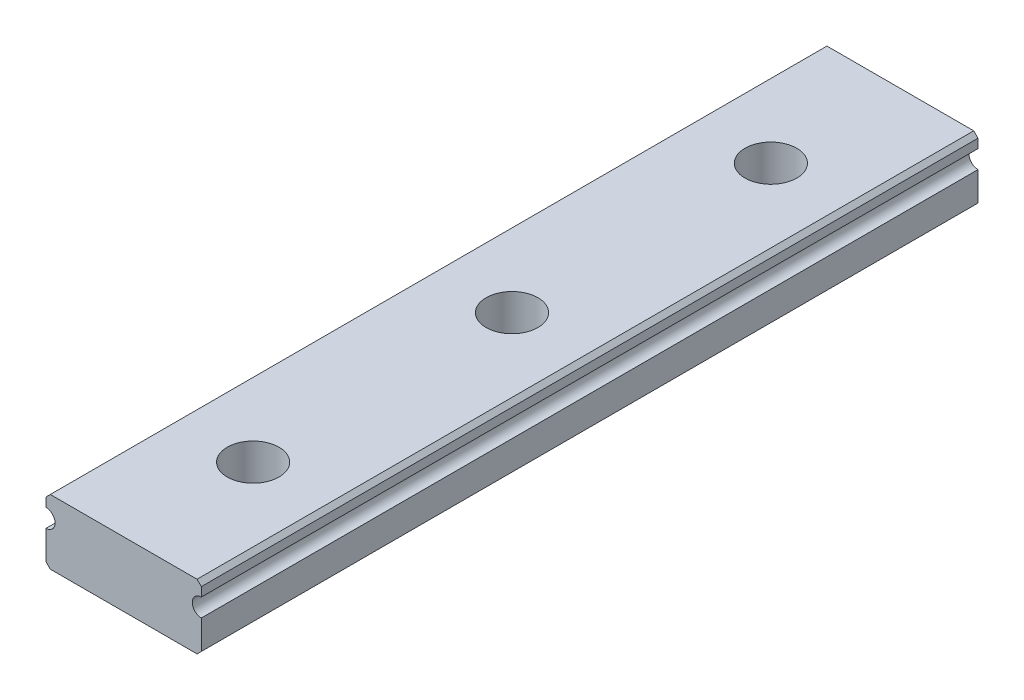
ISO-10303-21;
HEADER;
FILE_DESCRIPTION(('STEP AP214'),'2;1');
FILE_NAME('part.step','',(''),(''),'','','');
FILE_SCHEMA(('AUTOMOTIVE_DESIGN { 1 0 10303 214 1 1 1 1 }'));
ENDSEC;
DATA;
#1=APPLICATION_CONTEXT('core data for automotive mechanical design processes');
#2=APPLICATION_PROTOCOL_DEFINITION('international standard','automotive_design',2000,#1);
#3=PRODUCT_CONTEXT('',#1,'mechanical');
#4=PRODUCT('Part','Part','',(#3));
#5=PRODUCT_RELATED_PRODUCT_CATEGORY('part','',(#4));
#6=PRODUCT_DEFINITION_FORMATION('','',#4);
#7=PRODUCT_DEFINITION_CONTEXT('part definition',#1,'design');
#8=PRODUCT_DEFINITION('design','',#6,#7);
#9=PRODUCT_DEFINITION_SHAPE('','',#8);
#10=(LENGTH_UNIT() NAMED_UNIT(*) SI_UNIT(.MILLI.,.METRE.));
#11=(NAMED_UNIT(*) PLANE_ANGLE_UNIT() SI_UNIT($,.RADIAN.));
#12=(NAMED_UNIT(*) SI_UNIT($,.STERADIAN.) SOLID_ANGLE_UNIT());
#13=UNCERTAINTY_MEASURE_WITH_UNIT(LENGTH_MEASURE(1.E-05),#10,'distance_accuracy_value','');
#14=(GEOMETRIC_REPRESENTATION_CONTEXT(3) GLOBAL_UNCERTAINTY_ASSIGNED_CONTEXT((#13)) GLOBAL_UNIT_ASSIGNED_CONTEXT((#10,
#11,#12)) REPRESENTATION_CONTEXT('',''));
#15=CARTESIAN_POINT('',(0.,0.,0.));
#16=DIRECTION('',(0.,0.,1.));
#17=DIRECTION('',(1.,0.,0.));
#18=AXIS2_PLACEMENT_3D('',#15,#16,#17);
#19=CARTESIAN_POINT('',(-9.,7.00502525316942,200.));
#20=DIRECTION('',(1.,0.,0.));
#21=DIRECTION('',(0.,0.,-1.));
#22=AXIS2_PLACEMENT_3D('',#19,#20,#21);
#23=PLANE('',#22);
#24=DIRECTION('',(0.,0.,1.));
#25=VECTOR('',#24,1.);
#26=CARTESIAN_POINT('',(-9.,7.00502525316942,200.));
#27=LINE('',#26,#25);
#28=CARTESIAN_POINT('',(-9.,7.00502525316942,115.));
#29=VERTEX_POINT('',#28);
#30=CARTESIAN_POINT('',(-9.,7.00502525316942,25.));
#31=VERTEX_POINT('',#30);
#32=EDGE_CURVE('E197',#29,#31,#27,.F.);
#33=ORIENTED_EDGE('',*,*,#32,.T.);
#34=DIRECTION('',(0.,1.,0.));
#35=VECTOR('',#34,1.);
#36=CARTESIAN_POINT('',(-9.,7.00502525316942,25.));
#37=LINE('',#36,#35);
#38=CARTESIAN_POINT('',(-9.,5.956,25.));
#39=VERTEX_POINT('',#38);
#40=EDGE_CURVE('E202',#39,#31,#37,.T.);
#41=ORIENTED_EDGE('',*,*,#40,.F.);
#42=DIRECTION('',(0.,0.,-1.));
#43=VECTOR('',#42,1.);
#44=CARTESIAN_POINT('',(-9.,5.956,200.));
#45=LINE('',#44,#43);
#46=CARTESIAN_POINT('',(-9.,5.956,115.));
#47=VERTEX_POINT('',#46);
#48=EDGE_CURVE('E163',#39,#47,#45,.F.);
#49=ORIENTED_EDGE('',*,*,#48,.T.);
#50=DIRECTION('',(0.,1.,0.));
#51=VECTOR('',#50,1.);
#52=CARTESIAN_POINT('',(-9.,7.00502525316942,115.));
#53=LINE('',#52,#51);
#54=EDGE_CURVE('E126',#29,#47,#53,.F.);
#55=ORIENTED_EDGE('',*,*,#54,.F.);
#56=EDGE_LOOP('',(#33,#41,#49,#55));
#57=FACE_BOUND('',#56,.T.);
#58=ADVANCED_FACE('F17',(#57),#23,.F.);
#59=CARTESIAN_POINT('',(9.,5.956,200.));
#60=DIRECTION('',(-1.,0.,0.));
#61=DIRECTION('',(0.,0.,1.));
#62=AXIS2_PLACEMENT_3D('',#59,#60,#61);
#63=PLANE('',#62);
#64=DIRECTION('',(0.,0.,-1.));
#65=VECTOR('',#64,1.);
#66=CARTESIAN_POINT('',(9.,5.956,200.));
#67=LINE('',#66,#65);
#68=CARTESIAN_POINT('',(9.,5.956,115.));
#69=VERTEX_POINT('',#68);
#70=CARTESIAN_POINT('',(9.,5.956,25.));
#71=VERTEX_POINT('',#70);
#72=EDGE_CURVE('E109',#69,#71,#67,.T.);
#73=ORIENTED_EDGE('',*,*,#72,.T.);
#74=DIRECTION('',(0.,1.,0.));
#75=VECTOR('',#74,1.);
#76=CARTESIAN_POINT('',(9.,5.956,25.));
#77=LINE('',#76,#75);
#78=CARTESIAN_POINT('',(9.,7.00502525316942,25.));
#79=VERTEX_POINT('',#78);
#80=EDGE_CURVE('E117',#79,#71,#77,.F.);
#81=ORIENTED_EDGE('',*,*,#80,.F.);
#82=DIRECTION('',(0.,0.,1.));
#83=VECTOR('',#82,1.);
#84=CARTESIAN_POINT('',(9.,7.00502525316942,200.));
#85=LINE('',#84,#83);
#86=CARTESIAN_POINT('',(9.,7.00502525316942,115.));
#87=VERTEX_POINT('',#86);
#88=EDGE_CURVE('E211',#79,#87,#85,.T.);
#89=ORIENTED_EDGE('',*,*,#88,.T.);
#90=DIRECTION('',(0.,1.,0.));
#91=VECTOR('',#90,1.);
#92=CARTESIAN_POINT('',(9.,5.956,115.));
#93=LINE('',#92,#91);
#94=EDGE_CURVE('E125',#69,#87,#93,.T.);
#95=ORIENTED_EDGE('',*,*,#94,.F.);
#96=EDGE_LOOP('',(#73,#81,#89,#95));
#97=FACE_BOUND('',#96,.T.);
#98=ADVANCED_FACE('F128',(#97),#63,.F.);
#99=CARTESIAN_POINT('',(0.,0.,100.));
#100=DIRECTION('',(0.,1.,0.));
#101=DIRECTION('',(0.,0.,1.));
#102=AXIS2_PLACEMENT_3D('',#99,#100,#101);
#103=CYLINDRICAL_SURFACE('',#102,3.);
#104=CARTESIAN_POINT('',(0.,3.,100.));
#105=DIRECTION('',(0.,1.,0.));
#106=DIRECTION('',(0.,0.,1.));
#107=AXIS2_PLACEMENT_3D('',#104,#105,#106);
#108=CIRCLE('',#107,3.);
#109=CARTESIAN_POINT('',(0.,3.,103.));
#110=VERTEX_POINT('',#109);
#111=EDGE_CURVE('E20',#110,#110,#108,.T.);
#112=ORIENTED_EDGE('',*,*,#111,.F.);
#113=EDGE_LOOP('',(#112));
#114=FACE_BOUND('',#113,.T.);
#115=CARTESIAN_POINT('',(0.,7.5,100.));
#116=DIRECTION('',(0.,1.,0.));
#117=DIRECTION('',(0.,0.,1.));
#118=AXIS2_PLACEMENT_3D('',#115,#116,#117);
#119=CIRCLE('',#118,3.);
#120=CARTESIAN_POINT('',(0.,7.5,103.));
#121=VERTEX_POINT('',#120);
#122=EDGE_CURVE('E129',#121,#121,#119,.T.);
#123=ORIENTED_EDGE('',*,*,#122,.T.);
#124=EDGE_LOOP('',(#123));
#125=FACE_BOUND('',#124,.T.);
#126=ADVANCED_FACE('F270',(#114,#125),#103,.F.);
#127=CARTESIAN_POINT('',(0.,0.,70.));
#128=DIRECTION('',(0.,1.,0.));
#129=DIRECTION('',(0.,0.,1.));
#130=AXIS2_PLACEMENT_3D('',#127,#128,#129);
#131=CYLINDRICAL_SURFACE('',#130,3.);
#132=CARTESIAN_POINT('',(0.,3.,70.));
#133=DIRECTION('',(0.,1.,0.));
#134=DIRECTION('',(0.,0.,1.));
#135=AXIS2_PLACEMENT_3D('',#132,#133,#134);
#136=CIRCLE('',#135,3.);
#137=CARTESIAN_POINT('',(0.,3.,73.));
#138=VERTEX_POINT('',#137);
#139=EDGE_CURVE('E261',#138,#138,#136,.T.);
#140=ORIENTED_EDGE('',*,*,#139,.F.);
#141=EDGE_LOOP('',(#140));
#142=FACE_BOUND('',#141,.T.);
#143=CARTESIAN_POINT('',(0.,7.5,70.));
#144=DIRECTION('',(0.,1.,0.));
#145=DIRECTION('',(0.,0.,1.));
#146=AXIS2_PLACEMENT_3D('',#143,#144,#145);
#147=CIRCLE('',#146,3.);
#148=CARTESIAN_POINT('',(0.,7.5,73.));
#149=VERTEX_POINT('',#148);
#150=EDGE_CURVE('E132',#149,#149,#147,.T.);
#151=ORIENTED_EDGE('',*,*,#150,.T.);
#152=EDGE_LOOP('',(#151));
#153=FACE_BOUND('',#152,.T.);
#154=ADVANCED_FACE('F273',(#142,#153),#131,.F.);
#155=CARTESIAN_POINT('',(0.,0.,40.));
#156=DIRECTION('',(0.,1.,0.));
#157=DIRECTION('',(0.,0.,1.));
#158=AXIS2_PLACEMENT_3D('',#155,#156,#157);
#159=CYLINDRICAL_SURFACE('',#158,3.);
#160=CARTESIAN_POINT('',(0.,3.,40.));
#161=DIRECTION('',(0.,1.,0.));
#162=DIRECTION('',(0.,0.,1.));
#163=AXIS2_PLACEMENT_3D('',#160,#161,#162);
#164=CIRCLE('',#163,3.);
#165=CARTESIAN_POINT('',(0.,3.,43.));
#166=VERTEX_POINT('',#165);
#167=EDGE_CURVE('E177',#166,#166,#164,.T.);
#168=ORIENTED_EDGE('',*,*,#167,.F.);
#169=EDGE_LOOP('',(#168));
#170=FACE_BOUND('',#169,.T.);
#171=CARTESIAN_POINT('',(0.,7.5,40.));
#172=DIRECTION('',(0.,1.,0.));
#173=DIRECTION('',(0.,0.,1.));
#174=AXIS2_PLACEMENT_3D('',#171,#172,#173);
#175=CIRCLE('',#174,3.);
#176=CARTESIAN_POINT('',(0.,7.5,43.));
#177=VERTEX_POINT('',#176);
#178=EDGE_CURVE('E255',#177,#177,#175,.T.);
#179=ORIENTED_EDGE('',*,*,#178,.T.);
#180=EDGE_LOOP('',(#179));
#181=FACE_BOUND('',#180,.T.);
#182=ADVANCED_FACE('F350',(#170,#181),#159,.F.);
#183=CARTESIAN_POINT('',(-8.50502525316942,7.5,200.));
#184=DIRECTION('',(0.707106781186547,-0.707106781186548,0.));
#185=DIRECTION('',(0.707106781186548,0.707106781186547,0.));
#186=AXIS2_PLACEMENT_3D('',#183,#184,#185);
#187=PLANE('',#186);
#188=DIRECTION('',(0.,0.,-1.));
#189=VECTOR('',#188,1.);
#190=CARTESIAN_POINT('',(-8.50502525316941,7.5,200.));
#191=LINE('',#190,#189);
#192=CARTESIAN_POINT('',(-8.50502525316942,7.5,115.));
#193=VERTEX_POINT('',#192);
#194=CARTESIAN_POINT('',(-8.50502525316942,7.5,25.));
#195=VERTEX_POINT('',#194);
#196=EDGE_CURVE('E137',#193,#195,#191,.T.);
#197=ORIENTED_EDGE('',*,*,#196,.T.);
#198=DIRECTION('',(0.707106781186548,0.707106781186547,0.));
#199=VECTOR('',#198,1.);
#200=CARTESIAN_POINT('',(-8.50502525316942,7.5,25.));
#201=LINE('',#200,#199);
#202=EDGE_CURVE('E223',#31,#195,#201,.T.);
#203=ORIENTED_EDGE('',*,*,#202,.F.);
#204=ORIENTED_EDGE('',*,*,#32,.F.);
#205=DIRECTION('',(0.707106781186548,0.707106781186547,0.));
#206=VECTOR('',#205,1.);
#207=CARTESIAN_POINT('',(-8.50502525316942,7.5,115.));
#208=LINE('',#207,#206);
#209=EDGE_CURVE('E218',#193,#29,#208,.F.);
#210=ORIENTED_EDGE('',*,*,#209,.F.);
#211=EDGE_LOOP('',(#197,#203,#204,#210));
#212=FACE_BOUND('',#211,.T.);
#213=ADVANCED_FACE('F346',(#212),#187,.F.);
#214=CARTESIAN_POINT('',(9.,7.00502525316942,200.));
#215=DIRECTION('',(-0.707106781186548,-0.707106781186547,0.));
#216=DIRECTION('',(0.707106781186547,-0.707106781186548,0.));
#217=AXIS2_PLACEMENT_3D('',#214,#215,#216);
#218=PLANE('',#217);
#219=ORIENTED_EDGE('',*,*,#88,.F.);
#220=DIRECTION('',(0.707106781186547,-0.707106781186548,0.));
#221=VECTOR('',#220,1.);
#222=CARTESIAN_POINT('',(9.,7.00502525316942,25.));
#223=LINE('',#222,#221);
#224=CARTESIAN_POINT('',(8.50502525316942,7.5,25.));
#225=VERTEX_POINT('',#224);
#226=EDGE_CURVE('E121',#225,#79,#223,.T.);
#227=ORIENTED_EDGE('',*,*,#226,.F.);
#228=DIRECTION('',(0.,0.,-1.));
#229=VECTOR('',#228,1.);
#230=CARTESIAN_POINT('',(8.50502525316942,7.5,200.));
#231=LINE('',#230,#229);
#232=CARTESIAN_POINT('',(8.50502525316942,7.5,115.));
#233=VERTEX_POINT('',#232);
#234=EDGE_CURVE('E254',#225,#233,#231,.F.);
#235=ORIENTED_EDGE('',*,*,#234,.T.);
#236=DIRECTION('',(0.707106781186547,-0.707106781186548,0.));
#237=VECTOR('',#236,1.);
#238=CARTESIAN_POINT('',(9.,7.00502525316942,115.));
#239=LINE('',#238,#237);
#240=EDGE_CURVE('E209',#87,#233,#239,.F.);
#241=ORIENTED_EDGE('',*,*,#240,.F.);
#242=EDGE_LOOP('',(#219,#227,#235,#241));
#243=FACE_BOUND('',#242,.T.);
#244=ADVANCED_FACE('F339',(#243),#218,.F.);
#245=CARTESIAN_POINT('',(0.,3.,97.));
#246=DIRECTION('',(0.,1.,0.));
#247=DIRECTION('',(0.,0.,1.));
#248=AXIS2_PLACEMENT_3D('',#245,#246,#247);
#249=PLANE('',#248);
#250=CARTESIAN_POINT('',(0.,3.,100.));
#251=DIRECTION('',(0.,1.,0.));
#252=DIRECTION('',(0.,0.,1.));
#253=AXIS2_PLACEMENT_3D('',#250,#251,#252);
#254=CIRCLE('',#253,1.75);
#255=CARTESIAN_POINT('',(0.,3.,101.75));
#256=VERTEX_POINT('',#255);
#257=EDGE_CURVE('E251',#256,#256,#254,.F.);
#258=ORIENTED_EDGE('',*,*,#257,.T.);
#259=EDGE_LOOP('',(#258));
#260=FACE_BOUND('',#259,.T.);
#261=ORIENTED_EDGE('',*,*,#111,.T.);
#262=EDGE_LOOP('',(#261));
#263=FACE_BOUND('',#262,.T.);
#264=ADVANCED_FACE('F268',(#260,#263),#249,.T.);
#265=CARTESIAN_POINT('',(0.,3.,67.));
#266=DIRECTION('',(0.,1.,0.));
#267=DIRECTION('',(0.,0.,1.));
#268=AXIS2_PLACEMENT_3D('',#265,#266,#267);
#269=PLANE('',#268);
#270=CARTESIAN_POINT('',(0.,3.,70.));
#271=DIRECTION('',(0.,1.,0.));
#272=DIRECTION('',(0.,0.,1.));
#273=AXIS2_PLACEMENT_3D('',#270,#271,#272);
#274=CIRCLE('',#273,1.75);
#275=CARTESIAN_POINT('',(0.,3.,71.75));
#276=VERTEX_POINT('',#275);
#277=EDGE_CURVE('E248',#276,#276,#274,.F.);
#278=ORIENTED_EDGE('',*,*,#277,.T.);
#279=EDGE_LOOP('',(#278));
#280=FACE_BOUND('',#279,.T.);
#281=ORIENTED_EDGE('',*,*,#139,.T.);
#282=EDGE_LOOP('',(#281));
#283=FACE_BOUND('',#282,.T.);
#284=ADVANCED_FACE('F328',(#280,#283),#269,.T.);
#285=CARTESIAN_POINT('',(0.,3.,37.));
#286=DIRECTION('',(0.,1.,0.));
#287=DIRECTION('',(0.,0.,1.));
#288=AXIS2_PLACEMENT_3D('',#285,#286,#287);
#289=PLANE('',#288);
#290=CARTESIAN_POINT('',(0.,3.,40.));
#291=DIRECTION('',(0.,1.,0.));
#292=DIRECTION('',(0.,0.,1.));
#293=AXIS2_PLACEMENT_3D('',#290,#291,#292);
#294=CIRCLE('',#293,1.75);
#295=CARTESIAN_POINT('',(0.,3.,41.75));
#296=VERTEX_POINT('',#295);
#297=EDGE_CURVE('E149',#296,#296,#294,.F.);
#298=ORIENTED_EDGE('',*,*,#297,.T.);
#299=EDGE_LOOP('',(#298));
#300=FACE_BOUND('',#299,.T.);
#301=ORIENTED_EDGE('',*,*,#167,.T.);
#302=EDGE_LOOP('',(#301));
#303=FACE_BOUND('',#302,.T.);
#304=ADVANCED_FACE('F330',(#300,#303),#289,.T.);
#305=CARTESIAN_POINT('',(-9.,4.906,200.));
#306=DIRECTION('',(0.,0.,-1.));
#307=DIRECTION('',(-1.,0.,0.));
#308=AXIS2_PLACEMENT_3D('',#305,#306,#307);
#309=CYLINDRICAL_SURFACE('',#308,1.05);
#310=ORIENTED_EDGE('',*,*,#48,.F.);
#311=CARTESIAN_POINT('',(-9.,4.906,25.));
#312=DIRECTION('',(0.,0.,-1.));
#313=DIRECTION('',(-1.,0.,0.));
#314=AXIS2_PLACEMENT_3D('',#311,#312,#313);
#315=CIRCLE('',#314,1.05);
#316=CARTESIAN_POINT('',(-9.,3.856,25.));
#317=VERTEX_POINT('',#316);
#318=EDGE_CURVE('E180',#317,#39,#315,.F.);
#319=ORIENTED_EDGE('',*,*,#318,.F.);
#320=DIRECTION('',(0.,0.,-1.));
#321=VECTOR('',#320,1.);
#322=CARTESIAN_POINT('',(-9.,3.856,200.));
#323=LINE('',#322,#321);
#324=CARTESIAN_POINT('',(-9.,3.856,115.));
#325=VERTEX_POINT('',#324);
#326=EDGE_CURVE('E134',#317,#325,#323,.F.);
#327=ORIENTED_EDGE('',*,*,#326,.T.);
#328=CARTESIAN_POINT('',(-9.,4.906,115.));
#329=DIRECTION('',(0.,0.,-1.));
#330=DIRECTION('',(-1.,0.,0.));
#331=AXIS2_PLACEMENT_3D('',#328,#329,#330);
#332=CIRCLE('',#331,1.05);
#333=EDGE_CURVE('E167',#47,#325,#332,.T.);
#334=ORIENTED_EDGE('',*,*,#333,.F.);
#335=EDGE_LOOP('',(#310,#319,#327,#334));
#336=FACE_BOUND('',#335,.T.);
#337=ADVANCED_FACE('F336',(#336),#309,.F.);
#338=CARTESIAN_POINT('',(-9.,3.856,200.));
#339=DIRECTION('',(1.,0.,0.));
#340=DIRECTION('',(0.,0.,-1.));
#341=AXIS2_PLACEMENT_3D('',#338,#339,#340);
#342=PLANE('',#341);
#343=ORIENTED_EDGE('',*,*,#326,.F.);
#344=DIRECTION('',(0.,1.,0.));
#345=VECTOR('',#344,1.);
#346=CARTESIAN_POINT('',(-9.,0.,25.));
#347=LINE('',#346,#345);
#348=CARTESIAN_POINT('',(-9.,0.494974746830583,24.9999999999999));
#349=VERTEX_POINT('',#348);
#350=EDGE_CURVE('E193',#349,#317,#347,.T.);
#351=ORIENTED_EDGE('',*,*,#350,.F.);
#352=DIRECTION('',(0.,0.,1.));
#353=VECTOR('',#352,1.);
#354=CARTESIAN_POINT('',(-9.,0.494974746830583,200.));
#355=LINE('',#354,#353);
#356=CARTESIAN_POINT('',(-9.,0.494974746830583,115.));
#357=VERTEX_POINT('',#356);
#358=EDGE_CURVE('E164',#349,#357,#355,.T.);
#359=ORIENTED_EDGE('',*,*,#358,.T.);
#360=DIRECTION('',(0.,1.,0.));
#361=VECTOR('',#360,1.);
#362=CARTESIAN_POINT('',(-9.,0.,115.));
#363=LINE('',#362,#361);
#364=EDGE_CURVE('E172',#325,#357,#363,.F.);
#365=ORIENTED_EDGE('',*,*,#364,.F.);
#366=EDGE_LOOP('',(#343,#351,#359,#365));
#367=FACE_BOUND('',#366,.T.);
#368=ADVANCED_FACE('F396',(#367),#342,.F.);
#369=CARTESIAN_POINT('',(9.,0.494974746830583,200.));
#370=DIRECTION('',(-1.,0.,0.));
#371=DIRECTION('',(0.,0.,1.));
#372=AXIS2_PLACEMENT_3D('',#369,#370,#371);
#373=PLANE('',#372);
#374=DIRECTION('',(0.,0.,1.));
#375=VECTOR('',#374,1.);
#376=CARTESIAN_POINT('',(9.,0.494974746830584,200.));
#377=LINE('',#376,#375);
#378=CARTESIAN_POINT('',(9.,0.494974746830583,115.));
#379=VERTEX_POINT('',#378);
#380=CARTESIAN_POINT('',(9.,0.494974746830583,25.));
#381=VERTEX_POINT('',#380);
#382=EDGE_CURVE('E146',#379,#381,#377,.F.);
#383=ORIENTED_EDGE('',*,*,#382,.T.);
#384=DIRECTION('',(0.,1.,0.));
#385=VECTOR('',#384,1.);
#386=CARTESIAN_POINT('',(9.,0.,25.));
#387=LINE('',#386,#385);
#388=CARTESIAN_POINT('',(9.,3.856,25.));
#389=VERTEX_POINT('',#388);
#390=EDGE_CURVE('E113',#389,#381,#387,.F.);
#391=ORIENTED_EDGE('',*,*,#390,.F.);
#392=DIRECTION('',(0.,0.,-1.));
#393=VECTOR('',#392,1.);
#394=CARTESIAN_POINT('',(9.,3.856,200.));
#395=LINE('',#394,#393);
#396=CARTESIAN_POINT('',(9.,3.856,115.));
#397=VERTEX_POINT('',#396);
#398=EDGE_CURVE('E102',#389,#397,#395,.F.);
#399=ORIENTED_EDGE('',*,*,#398,.T.);
#400=DIRECTION('',(0.,1.,0.));
#401=VECTOR('',#400,1.);
#402=CARTESIAN_POINT('',(9.,0.,115.));
#403=LINE('',#402,#401);
#404=EDGE_CURVE('E143',#379,#397,#403,.T.);
#405=ORIENTED_EDGE('',*,*,#404,.F.);
#406=EDGE_LOOP('',(#383,#391,#399,#405));
#407=FACE_BOUND('',#406,.T.);
#408=ADVANCED_FACE('F290',(#407),#373,.F.);
#409=CARTESIAN_POINT('',(9.,4.906,200.));
#410=DIRECTION('',(0.,0.,-1.));
#411=DIRECTION('',(-1.,0.,0.));
#412=AXIS2_PLACEMENT_3D('',#409,#410,#411);
#413=CYLINDRICAL_SURFACE('',#412,1.05);
#414=CARTESIAN_POINT('',(9.,4.906,115.));
#415=DIRECTION('',(0.,0.,-1.));
#416=DIRECTION('',(-1.,0.,0.));
#417=AXIS2_PLACEMENT_3D('',#414,#415,#416);
#418=CIRCLE('',#417,1.05);
#419=EDGE_CURVE('E242',#397,#69,#418,.T.);
#420=ORIENTED_EDGE('',*,*,#419,.F.);
#421=ORIENTED_EDGE('',*,*,#398,.F.);
#422=CARTESIAN_POINT('',(9.,4.906,25.));
#423=DIRECTION('',(0.,0.,-1.));
#424=DIRECTION('',(-1.,0.,0.));
#425=AXIS2_PLACEMENT_3D('',#422,#423,#424);
#426=CIRCLE('',#425,1.05);
#427=EDGE_CURVE('E105',#71,#389,#426,.F.);
#428=ORIENTED_EDGE('',*,*,#427,.F.);
#429=ORIENTED_EDGE('',*,*,#72,.F.);
#430=EDGE_LOOP('',(#420,#421,#428,#429));
#431=FACE_BOUND('',#430,.T.);
#432=ADVANCED_FACE('F107',(#431),#413,.F.);
#433=CARTESIAN_POINT('',(8.50502525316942,7.5,200.));
#434=DIRECTION('',(0.,-1.,0.));
#435=DIRECTION('',(0.,0.,-1.));
#436=AXIS2_PLACEMENT_3D('',#433,#434,#435);
#437=PLANE('',#436);
#438=ORIENTED_EDGE('',*,*,#234,.F.);
#439=DIRECTION('',(-1.,0.,0.));
#440=VECTOR('',#439,1.);
#441=CARTESIAN_POINT('',(-20.8836030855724,7.5,25.));
#442=LINE('',#441,#440);
#443=EDGE_CURVE('E114',#195,#225,#442,.F.);
#444=ORIENTED_EDGE('',*,*,#443,.F.);
#445=ORIENTED_EDGE('',*,*,#196,.F.);
#446=DIRECTION('',(1.,0.,0.));
#447=VECTOR('',#446,1.);
#448=CARTESIAN_POINT('',(-20.8836030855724,7.5,115.));
#449=LINE('',#448,#447);
#450=EDGE_CURVE('E241',#233,#193,#449,.F.);
#451=ORIENTED_EDGE('',*,*,#450,.F.);
#452=EDGE_LOOP('',(#438,#444,#445,#451));
#453=FACE_BOUND('',#452,.T.);
#454=ORIENTED_EDGE('',*,*,#178,.F.);
#455=EDGE_LOOP('',(#454));
#456=FACE_BOUND('',#455,.T.);
#457=ORIENTED_EDGE('',*,*,#150,.F.);
#458=EDGE_LOOP('',(#457));
#459=FACE_BOUND('',#458,.T.);
#460=ORIENTED_EDGE('',*,*,#122,.F.);
#461=EDGE_LOOP('',(#460));
#462=FACE_BOUND('',#461,.T.);
#463=ADVANCED_FACE('F277',(#453,#456,#459,#462),#437,.F.);
#464=CARTESIAN_POINT('',(0.,0.,100.));
#465=DIRECTION('',(0.,1.,0.));
#466=DIRECTION('',(0.,0.,1.));
#467=AXIS2_PLACEMENT_3D('',#464,#465,#466);
#468=CYLINDRICAL_SURFACE('',#467,1.75);
#469=CARTESIAN_POINT('',(0.,0.,100.));
#470=DIRECTION('',(0.,1.,0.));
#471=DIRECTION('',(0.,0.,1.));
#472=AXIS2_PLACEMENT_3D('',#469,#470,#471);
#473=CIRCLE('',#472,1.75);
#474=CARTESIAN_POINT('',(0.,0.,101.75));
#475=VERTEX_POINT('',#474);
#476=EDGE_CURVE('E238',#475,#475,#473,.F.);
#477=ORIENTED_EDGE('',*,*,#476,.T.);
#478=EDGE_LOOP('',(#477));
#479=FACE_BOUND('',#478,.T.);
#480=ORIENTED_EDGE('',*,*,#257,.F.);
#481=EDGE_LOOP('',(#480));
#482=FACE_BOUND('',#481,.T.);
#483=ADVANCED_FACE('F279',(#479,#482),#468,.F.);
#484=CARTESIAN_POINT('',(0.,0.,70.));
#485=DIRECTION('',(0.,1.,0.));
#486=DIRECTION('',(0.,0.,1.));
#487=AXIS2_PLACEMENT_3D('',#484,#485,#486);
#488=CYLINDRICAL_SURFACE('',#487,1.75);
#489=CARTESIAN_POINT('',(0.,0.,70.));
#490=DIRECTION('',(0.,1.,0.));
#491=DIRECTION('',(0.,0.,1.));
#492=AXIS2_PLACEMENT_3D('',#489,#490,#491);
#493=CIRCLE('',#492,1.75);
#494=CARTESIAN_POINT('',(0.,0.,71.75));
#495=VERTEX_POINT('',#494);
#496=EDGE_CURVE('E235',#495,#495,#493,.F.);
#497=ORIENTED_EDGE('',*,*,#496,.T.);
#498=EDGE_LOOP('',(#497));
#499=FACE_BOUND('',#498,.T.);
#500=ORIENTED_EDGE('',*,*,#277,.F.);
#501=EDGE_LOOP('',(#500));
#502=FACE_BOUND('',#501,.T.);
#503=ADVANCED_FACE('F287',(#499,#502),#488,.F.);
#504=CARTESIAN_POINT('',(0.,0.,40.));
#505=DIRECTION('',(0.,1.,0.));
#506=DIRECTION('',(0.,0.,1.));
#507=AXIS2_PLACEMENT_3D('',#504,#505,#506);
#508=CYLINDRICAL_SURFACE('',#507,1.75);
#509=CARTESIAN_POINT('',(0.,0.,40.));
#510=DIRECTION('',(0.,1.,0.));
#511=DIRECTION('',(0.,0.,1.));
#512=AXIS2_PLACEMENT_3D('',#509,#510,#511);
#513=CIRCLE('',#512,1.75);
#514=CARTESIAN_POINT('',(0.,0.,41.75));
#515=VERTEX_POINT('',#514);
#516=EDGE_CURVE('E156',#515,#515,#513,.F.);
#517=ORIENTED_EDGE('',*,*,#516,.T.);
#518=EDGE_LOOP('',(#517));
#519=FACE_BOUND('',#518,.T.);
#520=ORIENTED_EDGE('',*,*,#297,.F.);
#521=EDGE_LOOP('',(#520));
#522=FACE_BOUND('',#521,.T.);
#523=ADVANCED_FACE('F315',(#519,#522),#508,.F.);
#524=CARTESIAN_POINT('',(8.50502525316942,0.,200.));
#525=DIRECTION('',(-0.707106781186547,0.707106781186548,0.));
#526=DIRECTION('',(-0.707106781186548,-0.707106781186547,0.));
#527=AXIS2_PLACEMENT_3D('',#524,#525,#526);
#528=PLANE('',#527);
#529=DIRECTION('',(0.,0.,1.));
#530=VECTOR('',#529,1.);
#531=CARTESIAN_POINT('',(8.50502525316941,0.,200.));
#532=LINE('',#531,#530);
#533=CARTESIAN_POINT('',(8.50502525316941,0.,115.));
#534=VERTEX_POINT('',#533);
#535=CARTESIAN_POINT('',(8.50502525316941,0.,25.));
#536=VERTEX_POINT('',#535);
#537=EDGE_CURVE('E152',#534,#536,#532,.F.);
#538=ORIENTED_EDGE('',*,*,#537,.T.);
#539=DIRECTION('',(-0.707106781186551,-0.707106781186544,0.));
#540=VECTOR('',#539,1.);
#541=CARTESIAN_POINT('',(9.,0.494974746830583,25.));
#542=LINE('',#541,#540);
#543=EDGE_CURVE('E191',#381,#536,#542,.T.);
#544=ORIENTED_EDGE('',*,*,#543,.F.);
#545=ORIENTED_EDGE('',*,*,#382,.F.);
#546=DIRECTION('',(0.707106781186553,0.707106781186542,0.));
#547=VECTOR('',#546,1.);
#548=CARTESIAN_POINT('',(8.50502525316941,0.,115.));
#549=LINE('',#548,#547);
#550=EDGE_CURVE('E140',#534,#379,#549,.T.);
#551=ORIENTED_EDGE('',*,*,#550,.F.);
#552=EDGE_LOOP('',(#538,#544,#545,#551));
#553=FACE_BOUND('',#552,.T.);
#554=ADVANCED_FACE('F312',(#553),#528,.F.);
#555=CARTESIAN_POINT('',(-20.8836030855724,0.,25.));
#556=DIRECTION('',(0.,0.,-1.));
#557=DIRECTION('',(-1.,0.,0.));
#558=AXIS2_PLACEMENT_3D('',#555,#556,#557);
#559=PLANE('',#558);
#560=ORIENTED_EDGE('',*,*,#318,.T.);
#561=ORIENTED_EDGE('',*,*,#40,.T.);
#562=ORIENTED_EDGE('',*,*,#202,.T.);
#563=ORIENTED_EDGE('',*,*,#443,.T.);
#564=ORIENTED_EDGE('',*,*,#226,.T.);
#565=ORIENTED_EDGE('',*,*,#80,.T.);
#566=ORIENTED_EDGE('',*,*,#427,.T.);
#567=ORIENTED_EDGE('',*,*,#390,.T.);
#568=ORIENTED_EDGE('',*,*,#543,.T.);
#569=DIRECTION('',(1.,0.,0.));
#570=VECTOR('',#569,1.);
#571=CARTESIAN_POINT('',(-8.50502525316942,0.,25.));
#572=LINE('',#571,#570);
#573=CARTESIAN_POINT('',(-8.50502525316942,0.,24.9999999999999));
#574=VERTEX_POINT('',#573);
#575=EDGE_CURVE('E155',#536,#574,#572,.F.);
#576=ORIENTED_EDGE('',*,*,#575,.T.);
#577=DIRECTION('',(-0.707106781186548,0.707106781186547,0.));
#578=VECTOR('',#577,1.);
#579=CARTESIAN_POINT('',(-9.,0.494974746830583,24.9999999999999));
#580=LINE('',#579,#578);
#581=EDGE_CURVE('E168',#574,#349,#580,.T.);
#582=ORIENTED_EDGE('',*,*,#581,.T.);
#583=ORIENTED_EDGE('',*,*,#350,.T.);
#584=EDGE_LOOP('',(#560,#561,#562,#563,#564,#565,#566,#567,#568,#576,#582,#583));
#585=FACE_BOUND('',#584,.T.);
#586=ADVANCED_FACE('F119',(#585),#559,.T.);
#587=CARTESIAN_POINT('',(-9.,0.494974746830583,200.));
#588=DIRECTION('',(0.707106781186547,0.707106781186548,0.));
#589=DIRECTION('',(-0.707106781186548,0.707106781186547,0.));
#590=AXIS2_PLACEMENT_3D('',#587,#588,#589);
#591=PLANE('',#590);
#592=ORIENTED_EDGE('',*,*,#358,.F.);
#593=ORIENTED_EDGE('',*,*,#581,.F.);
#594=DIRECTION('',(0.,0.,1.));
#595=VECTOR('',#594,1.);
#596=CARTESIAN_POINT('',(-8.50502525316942,0.,200.));
#597=LINE('',#596,#595);
#598=CARTESIAN_POINT('',(-8.50502525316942,0.,115.));
#599=VERTEX_POINT('',#598);
#600=EDGE_CURVE('E26',#574,#599,#597,.T.);
#601=ORIENTED_EDGE('',*,*,#600,.T.);
#602=DIRECTION('',(0.707106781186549,-0.707106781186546,0.));
#603=VECTOR('',#602,1.);
#604=CARTESIAN_POINT('',(-9.,0.494974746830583,115.));
#605=LINE('',#604,#603);
#606=EDGE_CURVE('E34',#357,#599,#605,.T.);
#607=ORIENTED_EDGE('',*,*,#606,.F.);
#608=EDGE_LOOP('',(#592,#593,#601,#607));
#609=FACE_BOUND('',#608,.T.);
#610=ADVANCED_FACE('F302',(#609),#591,.F.);
#611=CARTESIAN_POINT('',(-20.8836030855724,0.,115.));
#612=DIRECTION('',(0.,0.,1.));
#613=DIRECTION('',(1.,0.,0.));
#614=AXIS2_PLACEMENT_3D('',#611,#612,#613);
#615=PLANE('',#614);
#616=ORIENTED_EDGE('',*,*,#240,.T.);
#617=ORIENTED_EDGE('',*,*,#450,.T.);
#618=ORIENTED_EDGE('',*,*,#209,.T.);
#619=ORIENTED_EDGE('',*,*,#54,.T.);
#620=ORIENTED_EDGE('',*,*,#333,.T.);
#621=ORIENTED_EDGE('',*,*,#364,.T.);
#622=ORIENTED_EDGE('',*,*,#606,.T.);
#623=DIRECTION('',(1.,0.,0.));
#624=VECTOR('',#623,1.);
#625=CARTESIAN_POINT('',(-8.50502525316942,0.,115.));
#626=LINE('',#625,#624);
#627=EDGE_CURVE('E11',#599,#534,#626,.T.);
#628=ORIENTED_EDGE('',*,*,#627,.T.);
#629=ORIENTED_EDGE('',*,*,#550,.T.);
#630=ORIENTED_EDGE('',*,*,#404,.T.);
#631=ORIENTED_EDGE('',*,*,#419,.T.);
#632=ORIENTED_EDGE('',*,*,#94,.T.);
#633=EDGE_LOOP('',(#616,#617,#618,#619,#620,#621,#622,#628,#629,#630,#631,#632));
#634=FACE_BOUND('',#633,.T.);
#635=ADVANCED_FACE('F296',(#634),#615,.T.);
#636=CARTESIAN_POINT('',(-8.50502525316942,0.,200.));
#637=DIRECTION('',(0.,1.,0.));
#638=DIRECTION('',(0.,0.,1.));
#639=AXIS2_PLACEMENT_3D('',#636,#637,#638);
#640=PLANE('',#639);
#641=ORIENTED_EDGE('',*,*,#600,.F.);
#642=ORIENTED_EDGE('',*,*,#575,.F.);
#643=ORIENTED_EDGE('',*,*,#537,.F.);
#644=ORIENTED_EDGE('',*,*,#627,.F.);
#645=EDGE_LOOP('',(#641,#642,#643,#644));
#646=FACE_BOUND('',#645,.T.);
#647=ORIENTED_EDGE('',*,*,#516,.F.);
#648=EDGE_LOOP('',(#647));
#649=FACE_BOUND('',#648,.T.);
#650=ORIENTED_EDGE('',*,*,#496,.F.);
#651=EDGE_LOOP('',(#650));
#652=FACE_BOUND('',#651,.T.);
#653=ORIENTED_EDGE('',*,*,#476,.F.);
#654=EDGE_LOOP('',(#653));
#655=FACE_BOUND('',#654,.T.);
#656=ADVANCED_FACE('F294',(#646,#649,#652,#655),#640,.F.);
#657=CLOSED_SHELL('',(#58,#98,#126,#154,#182,#213,#244,#264,#284,#304,#337,#368,#408,#432,#463,
#483,#503,#523,#554,#586,#610,#635,#656));
#658=MANIFOLD_SOLID_BREP('B1',#657);
#659=ADVANCED_BREP_SHAPE_REPRESENTATION('',(#18,#658),#14);
#660=SHAPE_DEFINITION_REPRESENTATION(#9,#659);
ENDSEC;
END-ISO-10303-21;
